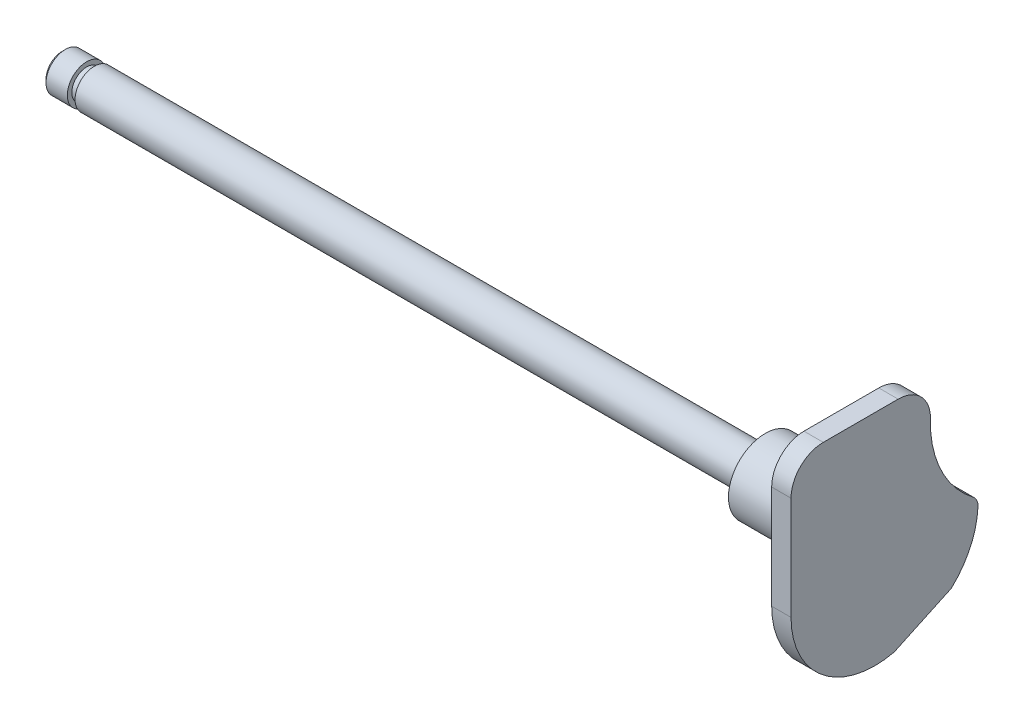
from build123d import *

# Parameters (mm, degrees)
BASE_EXTRUSION_DEPTH = 1.5
ESQUISSE2_R          = 2.85
BOSS_EXTRU_1_DEPTH   = 8.5
ESQUISSE3_R          = 1.5
BOSS_EXTRU_2_DEPTH   = 54.5
ESQUISSE4_W          = 0.6
ESQUISSE4_H          = 0.35
CHANFREIN1_SIZE      = 0.25


with BuildPart() as part:
    # Esquisse1 → Base-Extrusion (new body)
    with BuildSketch(Plane(origin=(0, 0, 0), x_dir=(0, 0, -1), z_dir=(1, 0, 0))):
        with BuildLine():
            Line((-8, 7.5), (-8, -0.5))
            ThreePointArc((-8, -0.5), (-5.531128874, -5.599019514), (0, -6.82455532))
            Line((0, -6.82455532), (4.425200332, -4.761050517))
            ThreePointArc((4.425200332, -4.761050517), (5.893318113, -2.74204333), (6.492187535, -0.318592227))
            ThreePointArc((6.492187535, -0.318592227), (6.400391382, 0.151548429), (6.100475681, 0.525057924))
            ThreePointArc((6.100475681, 0.525057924), (3.619664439, 3.580813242), (2.803182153, 7.431192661))
            ThreePointArc((2.803182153, 7.431192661), (2.09605812, 9.243270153), (0.304129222, 10))
            Line((0.304129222, 10), (-5.5, 10))
            ThreePointArc((-5.5, 10), (-7.267766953, 9.267766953), (-8, 7.5))
        make_face()
    extrude(amount=-BASE_EXTRUSION_DEPTH)

    # Esquisse2 → Boss.-Extru.1 (add)
    with BuildSketch(Plane.ZY.offset(1.5)):
        Circle(ESQUISSE2_R)
    extrude(amount=BOSS_EXTRU_1_DEPTH)

    # Esquisse3 → Boss.-Extru.2 (add)
    with BuildSketch(Plane.ZY.offset(10)):
        Circle(ESQUISSE3_R)
    extrude(amount=BOSS_EXTRU_2_DEPTH)

    # Esquisse4 → Enl_vement de mati_re-R_volution1 (revolve, cut)
    with BuildSketch(Plane.XY, mode=Mode.PRIVATE) as enl_vement_de_mati_re_r_volution1_sk:
        with Locations((-62.3, -1.325)):
            Rectangle(ESQUISSE4_W, ESQUISSE4_H)
    revolve(enl_vement_de_mati_re_r_volution1_sk.sketch.rotate(Axis((2.579598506, 0, 0), (-1, 0, 0)), 270), axis=Axis((2.579598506, 0, 0), (-1, 0, 0)), mode=Mode.SUBTRACT)

    # Chanfrein1
    chanfrein1_edges = [part.edges().sort_by_distance(p)[0] for p in [
        (-64.5, 0, -1.5),
    ]]
    chamfer(chanfrein1_edges, length=CHANFREIN1_SIZE)


solid = part.part
